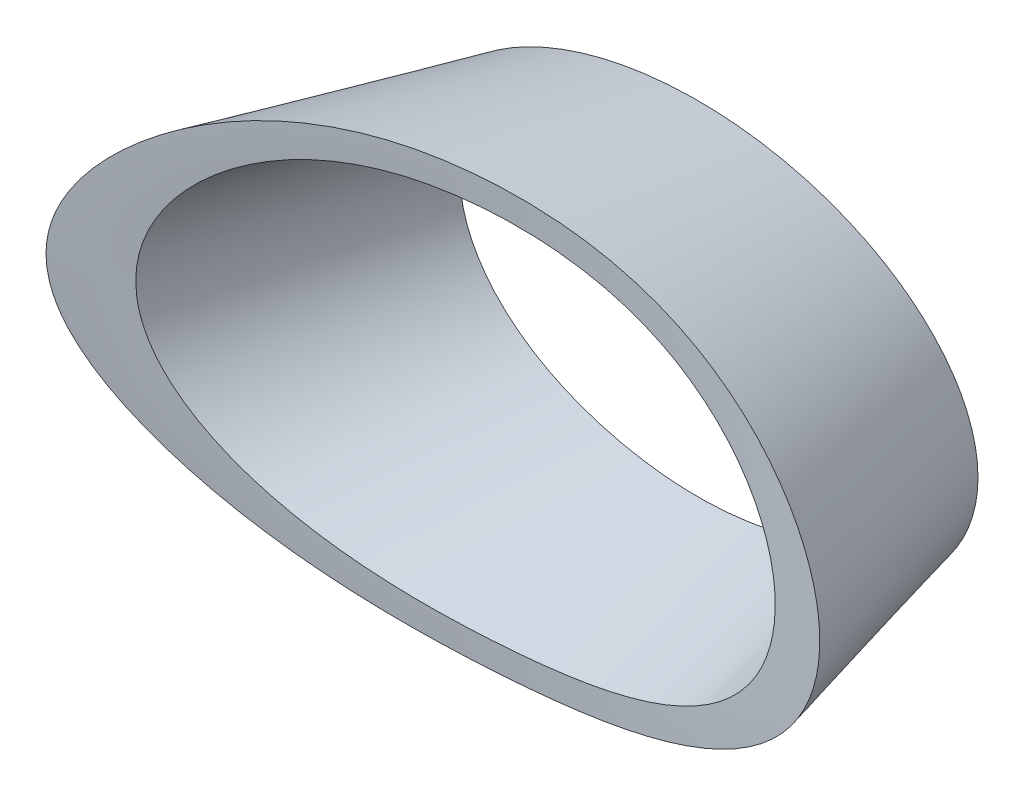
ISO-10303-21;
HEADER;
FILE_DESCRIPTION(('STEP AP214'),'2;1');
FILE_NAME('part.step','',(''),(''),'','','');
FILE_SCHEMA(('AUTOMOTIVE_DESIGN { 1 0 10303 214 1 1 1 1 }'));
ENDSEC;
DATA;
#1=APPLICATION_CONTEXT('core data for automotive mechanical design processes');
#2=APPLICATION_PROTOCOL_DEFINITION('international standard','automotive_design',2000,#1);
#3=PRODUCT_CONTEXT('',#1,'mechanical');
#4=PRODUCT('Part','Part','',(#3));
#5=PRODUCT_RELATED_PRODUCT_CATEGORY('part','',(#4));
#6=PRODUCT_DEFINITION_FORMATION('','',#4);
#7=PRODUCT_DEFINITION_CONTEXT('part definition',#1,'design');
#8=PRODUCT_DEFINITION('design','',#6,#7);
#9=PRODUCT_DEFINITION_SHAPE('','',#8);
#10=(LENGTH_UNIT() NAMED_UNIT(*) SI_UNIT(.MILLI.,.METRE.));
#11=(NAMED_UNIT(*) PLANE_ANGLE_UNIT() SI_UNIT($,.RADIAN.));
#12=(NAMED_UNIT(*) SI_UNIT($,.STERADIAN.) SOLID_ANGLE_UNIT());
#13=UNCERTAINTY_MEASURE_WITH_UNIT(LENGTH_MEASURE(1.E-05),#10,'distance_accuracy_value','');
#14=(GEOMETRIC_REPRESENTATION_CONTEXT(3) GLOBAL_UNCERTAINTY_ASSIGNED_CONTEXT((#13)) GLOBAL_UNIT_ASSIGNED_CONTEXT((#10,
#11,#12)) REPRESENTATION_CONTEXT('',''));
#15=CARTESIAN_POINT('',(0.,0.,0.));
#16=DIRECTION('',(0.,0.,1.));
#17=DIRECTION('',(1.,0.,0.));
#18=AXIS2_PLACEMENT_3D('',#15,#16,#17);
#19=CARTESIAN_POINT('',(-65.4830848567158,4.82925525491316E-06,52.7563388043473));
#20=CARTESIAN_POINT('',(-65.4831000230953,-1.72494443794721,52.7563438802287));
#21=CARTESIAN_POINT('',(-65.1156254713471,-5.16911474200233,52.6510681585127));
#22=CARTESIAN_POINT('',(-63.5266851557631,-10.1062699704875,52.2025886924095));
#23=CARTESIAN_POINT('',(-61.1027823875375,-14.6384907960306,51.5372634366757));
#24=CARTESIAN_POINT('',(-57.7186099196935,-19.1544386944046,50.6437351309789));
#25=CARTESIAN_POINT('',(-51.7328439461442,-25.0836126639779,49.1468713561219));
#26=CARTESIAN_POINT('',(-42.2539206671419,-31.1815931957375,47.0323357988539));
#27=CARTESIAN_POINT('',(-29.5288321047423,-35.9479075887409,44.7495300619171));
#28=CARTESIAN_POINT('',(-16.1322582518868,-38.4737901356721,42.9648858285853));
#29=CARTESIAN_POINT('',(-2.4341090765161,-39.1887560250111,41.7696370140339));
#30=CARTESIAN_POINT('',(11.251685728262,-38.5557845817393,41.2130712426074));
#31=CARTESIAN_POINT('',(24.8064785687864,-36.2657077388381,41.2819764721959));
#32=CARTESIAN_POINT('',(36.7115106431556,-32.1090578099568,41.8783296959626));
#33=CARTESIAN_POINT('',(46.4756342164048,-26.2943910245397,42.7250513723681));
#34=CARTESIAN_POINT('',(52.7715006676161,-20.4258532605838,43.4479515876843));
#35=CARTESIAN_POINT('',(57.7361239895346,-13.3855292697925,44.0979466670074));
#36=CARTESIAN_POINT('',(60.2995570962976,-6.78121546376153,44.4745030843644));
#37=CARTESIAN_POINT('',(60.9137009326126,0.104929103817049,44.5666152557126));
#38=CARTESIAN_POINT('',(60.2496557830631,6.98594312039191,44.4670294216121));
#39=CARTESIAN_POINT('',(57.7024648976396,13.4023376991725,44.0937148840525));
#40=CARTESIAN_POINT('',(52.7662050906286,20.4391020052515,43.4476060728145));
#41=CARTESIAN_POINT('',(46.5277408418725,26.2693666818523,42.7286568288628));
#42=CARTESIAN_POINT('',(36.6529613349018,32.1296128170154,41.8753155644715));
#43=CARTESIAN_POINT('',(24.8081079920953,36.2662062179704,41.2821712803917));
#44=CARTESIAN_POINT('',(11.2382370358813,38.5579341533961,41.2129765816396));
#45=CARTESIAN_POINT('',(-2.44764330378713,39.1888242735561,41.7705342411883));
#46=CARTESIAN_POINT('',(-16.145996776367,38.4712396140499,42.9666870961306));
#47=CARTESIAN_POINT('',(-29.5275380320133,35.9487549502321,44.7502895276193));
#48=CARTESIAN_POINT('',(-42.2540597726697,31.1814274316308,47.0320888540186));
#49=CARTESIAN_POINT('',(-51.7221201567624,25.090562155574,49.1444772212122));
#50=CARTESIAN_POINT('',(-57.710145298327,19.163695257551,50.6415421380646));
#51=CARTESIAN_POINT('',(-61.0931584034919,14.6544980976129,51.534659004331));
#52=CARTESIAN_POINT('',(-63.5239156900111,10.1123354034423,52.2018082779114));
#53=CARTESIAN_POINT('',(-65.1148326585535,5.17599910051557,52.6508409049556));
#54=CARTESIAN_POINT('',(-65.483069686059,1.7254405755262,52.7563337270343));
#55=CARTESIAN_POINT('',(-65.4830848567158,4.82925525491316E-06,52.7563388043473));
#56=CARTESIAN_POINT('',(-70.2749996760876,5.64163111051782E-06,54.2555337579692));
#57=CARTESIAN_POINT('',(-70.2750100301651,-1.82723067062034,54.255537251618));
#58=CARTESIAN_POINT('',(-69.8379614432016,-5.47368591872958,54.1196467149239));
#59=CARTESIAN_POINT('',(-68.0043417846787,-10.6425446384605,53.5608439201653));
#60=CARTESIAN_POINT('',(-65.2886348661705,-15.3393062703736,52.7610112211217));
#61=CARTESIAN_POINT('',(-61.5773791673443,-19.9973439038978,51.7148085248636));
#62=CARTESIAN_POINT('',(-55.1155726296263,-26.1089474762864,49.9970848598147));
#63=CARTESIAN_POINT('',(-45.0304228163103,-32.4411583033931,47.6187534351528));
#64=CARTESIAN_POINT('',(-31.5702609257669,-37.4714378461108,45.0772880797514));
#65=CARTESIAN_POINT('',(-17.3980585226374,-40.1969234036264,43.0983892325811));
#66=CARTESIAN_POINT('',(-2.90191620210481,-41.0131655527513,41.7872892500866));
#67=CARTESIAN_POINT('',(11.6077313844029,-40.3793789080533,41.1937751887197));
#68=CARTESIAN_POINT('',(25.9799707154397,-37.9906034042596,41.3079129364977));
#69=CARTESIAN_POINT('',(38.6086478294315,-33.6470495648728,42.0151050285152));
#70=CARTESIAN_POINT('',(48.9973355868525,-27.59528884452,43.0046985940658));
#71=CARTESIAN_POINT('',(55.7581081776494,-21.486597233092,43.8548875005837));
#72=CARTESIAN_POINT('',(61.1484467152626,-14.1371928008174,44.6296719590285));
#73=CARTESIAN_POINT('',(63.9957675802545,-7.18794137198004,45.0910355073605));
#74=CARTESIAN_POINT('',(64.6865338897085,0.111211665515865,45.2058010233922));
#75=CARTESIAN_POINT('',(63.9398541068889,7.40440457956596,45.0817786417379));
#76=CARTESIAN_POINT('',(61.1124951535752,14.1539910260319,44.6247458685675));
#77=CARTESIAN_POINT('',(55.7523529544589,21.5007124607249,43.8544544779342));
#78=CARTESIAN_POINT('',(49.0526686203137,27.5691757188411,43.0088960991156));
#79=CARTESIAN_POINT('',(38.5474611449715,33.6683112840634,42.0117078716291));
#80=CARTESIAN_POINT('',(25.9804967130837,37.9914218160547,41.3079929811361));
#81=CARTESIAN_POINT('',(11.5961395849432,40.3809259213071,41.1935191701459));
#82=CARTESIAN_POINT('',(-2.91365255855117,41.0133078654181,41.788060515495));
#83=CARTESIAN_POINT('',(-17.4103785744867,40.1945253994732,43.1001410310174));
#84=CARTESIAN_POINT('',(-31.5704283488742,37.4712766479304,45.0781973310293));
#85=CARTESIAN_POINT('',(-45.0302488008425,32.4413460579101,47.6184846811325));
#86=CARTESIAN_POINT('',(-55.1042463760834,26.116099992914,49.9944158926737));
#87=CARTESIAN_POINT('',(-61.5682296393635,20.0068224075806,51.7122859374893));
#88=CARTESIAN_POINT('',(-65.2779906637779,15.3558096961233,52.7579280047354));
#89=CARTESIAN_POINT('',(-68.0012206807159,10.6487962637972,53.5598992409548));
#90=CARTESIAN_POINT('',(-69.8370290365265,5.48090195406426,54.1193569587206));
#91=CARTESIAN_POINT('',(-70.27498931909,1.82775728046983,54.2555302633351));
#92=CARTESIAN_POINT('',(-70.2749996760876,5.64163111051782E-06,54.2555337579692));
#93=CARTESIAN_POINT('',(-75.0669144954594,6.4540069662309E-06,55.7547287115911));
#94=CARTESIAN_POINT('',(-75.0669200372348,-1.92951690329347,55.7547306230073));
#95=CARTESIAN_POINT('',(-74.560297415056,-5.77825709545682,55.588225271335));
#96=CARTESIAN_POINT('',(-72.4819984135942,-11.1788193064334,54.919099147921));
#97=CARTESIAN_POINT('',(-69.4744873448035,-16.0401217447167,53.9847590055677));
#98=CARTESIAN_POINT('',(-65.4361484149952,-20.8402491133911,52.7858819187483));
#99=CARTESIAN_POINT('',(-58.4983013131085,-27.1342822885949,50.8472983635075));
#100=CARTESIAN_POINT('',(-47.8069249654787,-33.7007234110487,48.2051710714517));
#101=CARTESIAN_POINT('',(-33.6116897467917,-38.9949681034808,45.4050460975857));
#102=CARTESIAN_POINT('',(-18.6638587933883,-41.9200566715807,43.2318926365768));
#103=CARTESIAN_POINT('',(-3.36972332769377,-42.8375750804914,41.8049414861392));
#104=CARTESIAN_POINT('',(11.9637770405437,-42.2029732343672,41.1744791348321));
#105=CARTESIAN_POINT('',(27.1534628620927,-39.7154990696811,41.3338494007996));
#106=CARTESIAN_POINT('',(40.5057850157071,-35.1850413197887,42.1518803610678));
#107=CARTESIAN_POINT('',(51.5190369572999,-28.8961866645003,43.2843458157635));
#108=CARTESIAN_POINT('',(58.7447156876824,-22.5473412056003,44.2618234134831));
#109=CARTESIAN_POINT('',(64.5607694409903,-14.8888563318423,45.1613972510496));
#110=CARTESIAN_POINT('',(67.691978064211,-7.59466728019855,45.7075679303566));
#111=CARTESIAN_POINT('',(68.459366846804,0.117494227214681,45.8449867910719));
#112=CARTESIAN_POINT('',(67.6300524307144,7.82286603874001,45.6965278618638));
#113=CARTESIAN_POINT('',(64.5225254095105,14.9056443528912,45.1557768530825));
#114=CARTESIAN_POINT('',(58.7385008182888,22.5623229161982,44.2613028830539));
#115=CARTESIAN_POINT('',(51.5775963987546,28.8689847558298,43.2891353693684));
#116=CARTESIAN_POINT('',(40.4419609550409,35.2070097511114,42.1481001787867));
#117=CARTESIAN_POINT('',(27.1528854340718,39.716637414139,41.3338146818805));
#118=CARTESIAN_POINT('',(11.9540421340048,42.2039176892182,41.1740617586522));
#119=CARTESIAN_POINT('',(-3.37966181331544,42.83779145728,41.8055867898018));
#120=CARTESIAN_POINT('',(-18.6747603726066,41.9178111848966,43.2335949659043));
#121=CARTESIAN_POINT('',(-33.6133186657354,38.9937983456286,45.4061051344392));
#122=CARTESIAN_POINT('',(-47.8064378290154,33.7012646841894,48.2048805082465));
#123=CARTESIAN_POINT('',(-58.4863725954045,27.141637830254,50.8443545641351));
#124=CARTESIAN_POINT('',(-65.4263139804,20.8499495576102,52.7830297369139));
#125=CARTESIAN_POINT('',(-69.4628229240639,16.0571212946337,53.9811970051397));
#126=CARTESIAN_POINT('',(-72.4785256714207,11.1852571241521,54.9179902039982));
#127=CARTESIAN_POINT('',(-74.5592254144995,5.78580480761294,55.5878730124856));
#128=CARTESIAN_POINT('',(-75.066908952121,1.93007398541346,55.7547267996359));
#129=CARTESIAN_POINT('',(-75.0669144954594,6.4540069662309E-06,55.7547287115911));
#130=CARTESIAN_POINT('',(-79.8588293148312,7.26638282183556E-06,57.253923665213));
#131=CARTESIAN_POINT('',(-79.8588300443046,-2.0318031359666,57.2539239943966));
#132=CARTESIAN_POINT('',(-79.2826333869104,-6.08282827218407,57.0568038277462));
#133=CARTESIAN_POINT('',(-76.9596550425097,-11.7150939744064,56.2773543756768));
#134=CARTESIAN_POINT('',(-73.6603398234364,-16.7409372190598,55.2085067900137));
#135=CARTESIAN_POINT('',(-69.294917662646,-21.6831543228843,53.856955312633));
#136=CARTESIAN_POINT('',(-61.8810299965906,-28.1596171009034,51.6975118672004));
#137=CARTESIAN_POINT('',(-50.5834271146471,-34.9602885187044,48.7915887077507));
#138=CARTESIAN_POINT('',(-35.6531185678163,-40.5184983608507,45.73280411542));
#139=CARTESIAN_POINT('',(-19.929659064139,-43.643189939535,43.3653960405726));
#140=CARTESIAN_POINT('',(-3.83753045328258,-44.6619846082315,41.8225937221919));
#141=CARTESIAN_POINT('',(12.3198226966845,-44.0265675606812,41.1551830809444));
#142=CARTESIAN_POINT('',(28.3269550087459,-41.4403947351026,41.3597858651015));
#143=CARTESIAN_POINT('',(42.4029222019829,-36.7230330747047,42.2886556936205));
#144=CARTESIAN_POINT('',(54.0407383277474,-30.1970844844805,43.5639930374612));
#145=CARTESIAN_POINT('',(61.7313231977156,-23.6080851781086,44.6687593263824));
#146=CARTESIAN_POINT('',(67.9730921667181,-15.6405198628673,45.6931225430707));
#147=CARTESIAN_POINT('',(71.3881885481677,-8.00139318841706,46.3241003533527));
#148=CARTESIAN_POINT('',(72.2321998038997,0.123776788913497,46.4841725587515));
#149=CARTESIAN_POINT('',(71.3202507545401,8.24132749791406,46.3112770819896));
#150=CARTESIAN_POINT('',(67.932555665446,15.6572976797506,45.6868078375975));
#151=CARTESIAN_POINT('',(61.7246486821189,23.6239333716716,44.6681512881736));
#152=CARTESIAN_POINT('',(54.1025241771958,30.1687937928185,43.5693746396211));
#153=CARTESIAN_POINT('',(42.3364607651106,36.7457082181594,42.2844924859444));
#154=CARTESIAN_POINT('',(28.3252741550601,41.4418530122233,41.3596363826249));
#155=CARTESIAN_POINT('',(12.3119446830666,44.0269094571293,41.1546043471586));
#156=CARTESIAN_POINT('',(-3.8456710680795,44.662275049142,41.8231130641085));
#157=CARTESIAN_POINT('',(-19.9391421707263,43.6410969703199,43.3670489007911));
#158=CARTESIAN_POINT('',(-35.6562089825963,40.5163200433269,45.7340129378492));
#159=CARTESIAN_POINT('',(-50.5826268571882,34.9611833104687,48.7912763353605));
#160=CARTESIAN_POINT('',(-61.8684988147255,28.167175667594,51.6942932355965));
#161=CARTESIAN_POINT('',(-69.2843983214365,21.6930767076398,53.8537735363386));
#162=CARTESIAN_POINT('',(-73.6476551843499,16.7584328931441,55.204466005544));
#163=CARTESIAN_POINT('',(-76.9558306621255,11.721717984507,56.2760811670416));
#164=CARTESIAN_POINT('',(-79.2814217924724,6.09070766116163,57.0563890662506));
#165=CARTESIAN_POINT('',(-79.858828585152,2.03239069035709,57.2539233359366));
#166=CARTESIAN_POINT('',(-79.8588293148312,7.26638282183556E-06,57.253923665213));
#167=B_SPLINE_SURFACE_WITH_KNOTS('',3,3,((#19,#20,#21,#22,#23,#24,#25,#26,#27,#28,#29,#30,#31,
#32,#33,#34,#35,#36,#37,#38,#39,#40,#41,#42,#43,#44,#45,#46,#47,#48,#49,#50,#51,#52,#53,#54,
#55),(#56,#57,#58,#59,#60,#61,#62,#63,#64,#65,#66,#67,#68,#69,#70,#71,#72,#73,#74,#75,#76,#77,
#78,#79,#80,#81,#82,#83,#84,#85,#86,#87,#88,#89,#90,#91,#92),(#93,#94,#95,#96,#97,#98,#99,#100,
#101,#102,#103,#104,#105,#106,#107,#108,#109,#110,#111,#112,#113,#114,#115,#116,#117,#118,#119,
#120,#121,#122,#123,#124,#125,#126,#127,#128,#129),(#130,#131,#132,#133,#134,#135,#136,#137,
#138,#139,#140,#141,#142,#143,#144,#145,#146,#147,#148,#149,#150,#151,#152,#153,#154,#155,#156,
#157,#158,#159,#160,#161,#162,#163,#164,#165,#166)),.UNSPECIFIED.,.F.,.T.,.F.,(4,4),(4,1,1,1,1,
1,1,1,1,1,1,1,1,1,1,1,1,1,1,1,1,1,1,1,1,1,1,1,1,1,1,1,1,1,4),(0.,1.),(0.,0.0157082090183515,
0.0313652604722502,0.0471860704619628,0.0627738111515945,0.0833333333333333,0.125,
0.166666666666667,0.208333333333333,0.25,0.291666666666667,0.333333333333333,0.375,
0.406194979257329,0.436595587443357,0.453287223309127,0.484684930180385,0.500267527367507,
0.516003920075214,0.547390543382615,0.562321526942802,0.594368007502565,0.625,0.666666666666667,
0.708333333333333,0.75012724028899,0.791666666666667,0.833333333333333,0.875,0.916666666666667,
0.937110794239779,0.952815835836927,0.968578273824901,0.984287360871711,1.),.UNSPECIFIED.);
#168=CARTESIAN_POINT('',(-65.4830848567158,4.82925525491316E-06,52.7563388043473));
#169=CARTESIAN_POINT('',(-65.4831000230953,-1.72494443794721,52.7563438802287));
#170=CARTESIAN_POINT('',(-65.1156254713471,-5.16911474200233,52.6510681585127));
#171=CARTESIAN_POINT('',(-63.5266851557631,-10.1062699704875,52.2025886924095));
#172=CARTESIAN_POINT('',(-61.1027823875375,-14.6384907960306,51.5372634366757));
#173=CARTESIAN_POINT('',(-57.7186099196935,-19.1544386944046,50.6437351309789));
#174=CARTESIAN_POINT('',(-51.7328439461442,-25.0836126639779,49.1468713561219));
#175=CARTESIAN_POINT('',(-42.2539206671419,-31.1815931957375,47.0323357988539));
#176=CARTESIAN_POINT('',(-29.5288321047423,-35.9479075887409,44.7495300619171));
#177=CARTESIAN_POINT('',(-16.1322582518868,-38.4737901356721,42.9648858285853));
#178=CARTESIAN_POINT('',(-2.4341090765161,-39.1887560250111,41.7696370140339));
#179=CARTESIAN_POINT('',(11.251685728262,-38.5557845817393,41.2130712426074));
#180=CARTESIAN_POINT('',(24.8064785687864,-36.2657077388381,41.2819764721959));
#181=CARTESIAN_POINT('',(36.7115106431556,-32.1090578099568,41.8783296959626));
#182=CARTESIAN_POINT('',(46.4756342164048,-26.2943910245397,42.7250513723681));
#183=CARTESIAN_POINT('',(52.7715006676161,-20.4258532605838,43.4479515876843));
#184=CARTESIAN_POINT('',(57.7361239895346,-13.3855292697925,44.0979466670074));
#185=CARTESIAN_POINT('',(60.2995570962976,-6.78121546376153,44.4745030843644));
#186=CARTESIAN_POINT('',(60.9137009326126,0.104929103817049,44.5666152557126));
#187=CARTESIAN_POINT('',(60.2496557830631,6.98594312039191,44.4670294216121));
#188=CARTESIAN_POINT('',(57.7024648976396,13.4023376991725,44.0937148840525));
#189=CARTESIAN_POINT('',(52.7662050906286,20.4391020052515,43.4476060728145));
#190=CARTESIAN_POINT('',(46.5277408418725,26.2693666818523,42.7286568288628));
#191=CARTESIAN_POINT('',(36.6529613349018,32.1296128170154,41.8753155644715));
#192=CARTESIAN_POINT('',(24.8081079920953,36.2662062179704,41.2821712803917));
#193=CARTESIAN_POINT('',(11.2382370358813,38.5579341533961,41.2129765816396));
#194=CARTESIAN_POINT('',(-2.44764330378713,39.1888242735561,41.7705342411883));
#195=CARTESIAN_POINT('',(-16.145996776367,38.4712396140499,42.9666870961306));
#196=CARTESIAN_POINT('',(-29.5275380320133,35.9487549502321,44.7502895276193));
#197=CARTESIAN_POINT('',(-42.2540597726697,31.1814274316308,47.0320888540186));
#198=CARTESIAN_POINT('',(-51.7221201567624,25.090562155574,49.1444772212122));
#199=CARTESIAN_POINT('',(-57.710145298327,19.163695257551,50.6415421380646));
#200=CARTESIAN_POINT('',(-61.0931584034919,14.6544980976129,51.534659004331));
#201=CARTESIAN_POINT('',(-63.5239156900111,10.1123354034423,52.2018082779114));
#202=CARTESIAN_POINT('',(-65.1148326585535,5.17599910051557,52.6508409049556));
#203=CARTESIAN_POINT('',(-65.483069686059,1.7254405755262,52.7563337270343));
#204=CARTESIAN_POINT('',(-65.4830848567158,4.82925525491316E-06,52.7563388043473));
#205=B_SPLINE_CURVE_WITH_KNOTS('',3,(#168,#169,#170,#171,#172,#173,#174,#175,#176,#177,#178,
#179,#180,#181,#182,#183,#184,#185,#186,#187,#188,#189,#190,#191,#192,#193,#194,#195,#196,#197,
#198,#199,#200,#201,#202,#203,#204),.UNSPECIFIED.,.T.,.F.,(4,1,1,1,1,1,1,1,1,1,1,1,1,1,1,1,1,1,
1,1,1,1,1,1,1,1,1,1,1,1,1,1,1,1,4),(0.,0.0157082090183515,0.0313652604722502,0.0471860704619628,
0.0627738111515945,0.0833333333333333,0.125,0.166666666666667,0.208333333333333,0.25,
0.291666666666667,0.333333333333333,0.375,0.406194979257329,0.436595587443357,0.453287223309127,
0.484684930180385,0.500267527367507,0.516003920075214,0.547390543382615,0.562321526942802,
0.594368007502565,0.625,0.666666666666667,0.708333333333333,0.75012724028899,0.791666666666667,
0.833333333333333,0.875,0.916666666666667,0.937110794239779,0.952815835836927,0.968578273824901,
0.984287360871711,1.),.UNSPECIFIED.);
#206=CARTESIAN_POINT('',(-65.4830848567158,4.82925525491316E-06,52.7563388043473));
#207=VERTEX_POINT('',#206);
#208=EDGE_CURVE('E47',#207,#207,#205,.F.);
#209=CARTESIAN_POINT('',(-79.8588293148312,7.26638282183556E-06,57.253923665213));
#210=CARTESIAN_POINT('',(-79.8588300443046,-2.0318031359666,57.2539239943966));
#211=CARTESIAN_POINT('',(-79.2826333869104,-6.08282827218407,57.0568038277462));
#212=CARTESIAN_POINT('',(-76.9596550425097,-11.7150939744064,56.2773543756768));
#213=CARTESIAN_POINT('',(-73.6603398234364,-16.7409372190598,55.2085067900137));
#214=CARTESIAN_POINT('',(-69.294917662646,-21.6831543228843,53.856955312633));
#215=CARTESIAN_POINT('',(-61.8810299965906,-28.1596171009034,51.6975118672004));
#216=CARTESIAN_POINT('',(-50.5834271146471,-34.9602885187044,48.7915887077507));
#217=CARTESIAN_POINT('',(-35.6531185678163,-40.5184983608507,45.73280411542));
#218=CARTESIAN_POINT('',(-19.929659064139,-43.643189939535,43.3653960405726));
#219=CARTESIAN_POINT('',(-3.83753045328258,-44.6619846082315,41.8225937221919));
#220=CARTESIAN_POINT('',(12.3198226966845,-44.0265675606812,41.1551830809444));
#221=CARTESIAN_POINT('',(28.3269550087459,-41.4403947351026,41.3597858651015));
#222=CARTESIAN_POINT('',(42.4029222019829,-36.7230330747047,42.2886556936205));
#223=CARTESIAN_POINT('',(54.0407383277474,-30.1970844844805,43.5639930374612));
#224=CARTESIAN_POINT('',(61.7313231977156,-23.6080851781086,44.6687593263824));
#225=CARTESIAN_POINT('',(67.9730921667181,-15.6405198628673,45.6931225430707));
#226=CARTESIAN_POINT('',(71.3881885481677,-8.00139318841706,46.3241003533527));
#227=CARTESIAN_POINT('',(72.2321998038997,0.123776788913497,46.4841725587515));
#228=CARTESIAN_POINT('',(71.3202507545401,8.24132749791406,46.3112770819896));
#229=CARTESIAN_POINT('',(67.932555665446,15.6572976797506,45.6868078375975));
#230=CARTESIAN_POINT('',(61.7246486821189,23.6239333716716,44.6681512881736));
#231=CARTESIAN_POINT('',(54.1025241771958,30.1687937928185,43.5693746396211));
#232=CARTESIAN_POINT('',(42.3364607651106,36.7457082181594,42.2844924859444));
#233=CARTESIAN_POINT('',(28.3252741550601,41.4418530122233,41.3596363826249));
#234=CARTESIAN_POINT('',(12.3119446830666,44.0269094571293,41.1546043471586));
#235=CARTESIAN_POINT('',(-3.8456710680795,44.662275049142,41.8231130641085));
#236=CARTESIAN_POINT('',(-19.9391421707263,43.6410969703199,43.3670489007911));
#237=CARTESIAN_POINT('',(-35.6562089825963,40.5163200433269,45.7340129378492));
#238=CARTESIAN_POINT('',(-50.5826268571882,34.9611833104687,48.7912763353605));
#239=CARTESIAN_POINT('',(-61.8684988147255,28.167175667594,51.6942932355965));
#240=CARTESIAN_POINT('',(-69.2843983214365,21.6930767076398,53.8537735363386));
#241=CARTESIAN_POINT('',(-73.6476551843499,16.7584328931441,55.204466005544));
#242=CARTESIAN_POINT('',(-76.9558306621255,11.721717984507,56.2760811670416));
#243=CARTESIAN_POINT('',(-79.2814217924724,6.09070766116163,57.0563890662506));
#244=CARTESIAN_POINT('',(-79.858828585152,2.03239069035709,57.2539233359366));
#245=CARTESIAN_POINT('',(-79.8588293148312,7.26638282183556E-06,57.253923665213));
#246=B_SPLINE_CURVE_WITH_KNOTS('',3,(#209,#210,#211,#212,#213,#214,#215,#216,#217,#218,#219,
#220,#221,#222,#223,#224,#225,#226,#227,#228,#229,#230,#231,#232,#233,#234,#235,#236,#237,#238,
#239,#240,#241,#242,#243,#244,#245),.UNSPECIFIED.,.T.,.F.,(4,1,1,1,1,1,1,1,1,1,1,1,1,1,1,1,1,1,
1,1,1,1,1,1,1,1,1,1,1,1,1,1,1,1,4),(0.,0.0157082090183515,0.0313652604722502,0.0471860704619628,
0.0627738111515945,0.0833333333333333,0.125,0.166666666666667,0.208333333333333,0.25,
0.291666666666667,0.333333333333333,0.375,0.406194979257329,0.436595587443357,0.453287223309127,
0.484684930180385,0.500267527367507,0.516003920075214,0.547390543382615,0.562321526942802,
0.594368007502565,0.625,0.666666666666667,0.708333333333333,0.75012724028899,0.791666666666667,
0.833333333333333,0.875,0.916666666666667,0.937110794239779,0.952815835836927,0.968578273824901,
0.984287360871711,1.),.UNSPECIFIED.);
#247=CARTESIAN_POINT('',(-79.8588293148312,7.26638282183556E-06,57.253923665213));
#248=VERTEX_POINT('',#247);
#249=EDGE_CURVE('E43',#248,#248,#246,.T.);
#250=ORIENTED_EDGE('',*,*,#208,.T.);
#251=EDGE_LOOP('',(#250));
#252=FACE_BOUND('',#251,.T.);
#253=ORIENTED_EDGE('',*,*,#249,.T.);
#254=EDGE_LOOP('',(#253));
#255=FACE_BOUND('',#254,.T.);
#256=ADVANCED_FACE('F30',(#252,#255),#167,.T.);
#257=CARTESIAN_POINT('',(-50.,0.,0.));
#258=CARTESIAN_POINT('',(-50.,-1.10298482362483,0.));
#259=CARTESIAN_POINT('',(-49.8218116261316,-3.30536233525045,0.));
#260=CARTESIAN_POINT('',(-49.0467663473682,-6.58231629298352,0.));
#261=CARTESIAN_POINT('',(-47.7944222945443,-9.7783179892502,0.));
#262=CARTESIAN_POINT('',(-45.9150133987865,-13.1869154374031,0.));
#263=CARTESIAN_POINT('',(-42.2984436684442,-18.0149405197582,0.));
#264=CARTESIAN_POINT('',(-35.787145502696,-23.6195160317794,0.));
#265=CARTESIAN_POINT('',(-25.5701519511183,-28.7900553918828,0.));
#266=CARTESIAN_POINT('',(-13.2986924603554,-32.1711895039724,0.));
#267=CARTESIAN_POINT('',(0.,-33.4144052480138,0.));
#268=CARTESIAN_POINT('',(13.2986924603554,-32.1711895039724,0.));
#269=CARTESIAN_POINT('',(25.5701519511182,-28.7900553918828,0.));
#270=CARTESIAN_POINT('',(34.9312322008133,-24.0526702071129,0.));
#271=CARTESIAN_POINT('',(41.6503659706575,-18.6453688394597,0.));
#272=CARTESIAN_POINT('',(45.5310340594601,-13.8848385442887,0.));
#273=CARTESIAN_POINT('',(48.374087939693,-8.73663416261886,0.));
#274=CARTESIAN_POINT('',(49.7471783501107,-4.33692923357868,0.));
#275=CARTESIAN_POINT('',(50.0885019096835,0.0672564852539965,0.));
#276=CARTESIAN_POINT('',(49.7198141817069,4.46984319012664,0.));
#277=CARTESIAN_POINT('',(48.3543369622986,8.7535786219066,0.));
#278=CARTESIAN_POINT('',(45.5265280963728,13.8945490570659,0.));
#279=CARTESIAN_POINT('',(41.6882496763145,18.6208205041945,0.));
#280=CARTESIAN_POINT('',(34.8852159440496,24.0759577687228,0.));
#281=CARTESIAN_POINT('',(25.5701519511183,28.7900567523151,0.));
#282=CARTESIAN_POINT('',(13.28620106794,32.1746246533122,0.));
#283=CARTESIAN_POINT('',(-0.0140598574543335,33.4142501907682,0.));
#284=CARTESIAN_POINT('',(-13.3111838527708,32.1677432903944,0.));
#285=CARTESIAN_POINT('',(-25.5701519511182,28.7900553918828,0.));
#286=CARTESIAN_POINT('',(-35.787145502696,23.6195160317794,0.));
#287=CARTESIAN_POINT('',(-42.2912115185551,18.0211655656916,0.));
#288=CARTESIAN_POINT('',(-45.9102070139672,13.1941910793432,0.));
#289=CARTESIAN_POINT('',(-47.7893682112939,9.78972903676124,0.));
#290=CARTESIAN_POINT('',(-49.0454462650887,6.58638419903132,0.));
#291=CARTESIAN_POINT('',(-49.821440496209,3.30963826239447,0.));
#292=CARTESIAN_POINT('',(-50.,1.10329589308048,0.));
#293=CARTESIAN_POINT('',(-50.,0.,0.));
#294=CARTESIAN_POINT('',(-55.1610282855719,1.60975175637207E-06,17.5854462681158));
#295=CARTESIAN_POINT('',(-55.1610333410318,-1.31030469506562,17.5854479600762));
#296=CARTESIAN_POINT('',(-54.9197495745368,-3.92661313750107,17.5503560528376));
#297=CARTESIAN_POINT('',(-53.8734059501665,-7.75696751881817,17.4008628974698));
#298=CARTESIAN_POINT('',(-52.230542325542,-11.3983755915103,17.1790878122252));
#299=CARTESIAN_POINT('',(-49.8495455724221,-15.1760898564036,16.8812450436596));
#300=CARTESIAN_POINT('',(-45.4432437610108,-20.3711645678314,16.3822904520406));
#301=CARTESIAN_POINT('',(-37.942737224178,-26.1402084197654,15.6774452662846));
#302=CARTESIAN_POINT('',(-26.8897120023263,-31.1760061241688,14.916510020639));
#303=CARTESIAN_POINT('',(-14.2432143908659,-34.2720563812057,14.3216286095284));
#304=CARTESIAN_POINT('',(-0.811369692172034,-35.3391888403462,13.9232123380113));
#305=CARTESIAN_POINT('',(12.6163568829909,-34.2993878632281,13.7376904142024));
#306=CARTESIAN_POINT('',(25.3155941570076,-31.2819395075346,13.7606588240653));
#307=CARTESIAN_POINT('',(35.5246583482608,-26.7381327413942,13.9594432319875));
#308=CARTESIAN_POINT('',(43.2587887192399,-21.195042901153,14.2416837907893));
#309=CARTESIAN_POINT('',(47.9445229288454,-16.0651767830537,14.4826505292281));
#310=CARTESIAN_POINT('',(51.4947666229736,-10.2862658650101,14.6993155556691));
#311=CARTESIAN_POINT('',(53.264637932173,-5.15169131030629,14.8248343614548));
#312=CARTESIAN_POINT('',(53.6969015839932,0.0798140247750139,14.8555384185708));
#313=CARTESIAN_POINT('',(53.2297613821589,5.30854316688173,14.8223431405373));
#314=CARTESIAN_POINT('',(51.4703796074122,10.3031649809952,14.6979049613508));
#315=CARTESIAN_POINT('',(47.9397537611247,16.0760667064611,14.4825353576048));
#316=CARTESIAN_POINT('',(43.3014133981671,21.1703358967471,14.2428856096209));
#317=CARTESIAN_POINT('',(35.474464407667,26.760509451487,13.9584385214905));
#318=CARTESIAN_POINT('',(25.3161372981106,31.2821065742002,13.7607237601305));
#319=CARTESIAN_POINT('',(12.6035463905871,34.3023944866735,13.7376588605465));
#320=CARTESIAN_POINT('',(-0.825254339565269,35.3391082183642,13.9235114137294));
#321=CARTESIAN_POINT('',(-14.2561214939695,34.2689087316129,14.3222290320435));
#322=CARTESIAN_POINT('',(-26.8892806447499,31.1762885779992,14.9167631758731));
#323=CARTESIAN_POINT('',(-37.9427835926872,26.1401531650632,15.6773629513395));
#324=CARTESIAN_POINT('',(-45.4348477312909,20.3776310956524,16.3814924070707));
#325=CARTESIAN_POINT('',(-49.8435197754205,15.1840258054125,16.8805140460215));
#326=CARTESIAN_POINT('',(-52.2239649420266,11.4113187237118,17.1782196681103));
#327=CARTESIAN_POINT('',(-53.8716027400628,7.76170126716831,17.4006027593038));
#328=CARTESIAN_POINT('',(-54.9192378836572,3.93175854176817,17.5502803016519));
#329=CARTESIAN_POINT('',(-55.1610232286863,1.31067745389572,17.5854445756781));
#330=CARTESIAN_POINT('',(-55.1610282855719,1.60975175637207E-06,17.5854462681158));
#331=CARTESIAN_POINT('',(-60.3220565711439,3.21950350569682E-06,35.1708925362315));
#332=CARTESIAN_POINT('',(-60.3220666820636,-1.51762456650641,35.1708959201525));
#333=CARTESIAN_POINT('',(-60.017687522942,-4.5478639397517,35.1007121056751));
#334=CARTESIAN_POINT('',(-58.7000455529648,-8.93161874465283,34.8017257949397));
#335=CARTESIAN_POINT('',(-56.6666623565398,-13.0184331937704,34.3581756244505));
#336=CARTESIAN_POINT('',(-53.7840777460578,-17.1652642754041,33.7624900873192));
#337=CARTESIAN_POINT('',(-48.5880438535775,-22.7273886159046,32.7645809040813));
#338=CARTESIAN_POINT('',(-40.09832894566,-28.6609008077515,31.3548905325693));
#339=CARTESIAN_POINT('',(-28.2092720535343,-33.5619568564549,29.833020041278));
#340=CARTESIAN_POINT('',(-15.1877363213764,-36.3729232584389,28.6432572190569));
#341=CARTESIAN_POINT('',(-1.62273938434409,-37.2639724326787,27.8464246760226));
#342=CARTESIAN_POINT('',(11.9340213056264,-36.4275862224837,27.4753808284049));
#343=CARTESIAN_POINT('',(25.061036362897,-33.7738236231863,27.5213176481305));
#344=CARTESIAN_POINT('',(36.1180844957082,-29.4235952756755,27.918886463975));
#345=CARTESIAN_POINT('',(44.8672114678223,-23.7447169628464,28.4833675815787));
#346=CARTESIAN_POINT('',(50.3580117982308,-18.2455150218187,28.9653010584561));
#347=CARTESIAN_POINT('',(54.6154453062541,-11.8358975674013,29.3986311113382));
#348=CARTESIAN_POINT('',(56.7820975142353,-5.96645338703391,29.6496687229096));
#349=CARTESIAN_POINT('',(57.3053012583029,0.0923715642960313,29.7110768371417));
#350=CARTESIAN_POINT('',(56.739708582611,6.14724314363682,29.6446862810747));
#351=CARTESIAN_POINT('',(54.5864222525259,11.8527513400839,29.3958099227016));
#352=CARTESIAN_POINT('',(50.3529794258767,18.2575843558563,28.9650707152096));
#353=CARTESIAN_POINT('',(44.9145771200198,23.7198512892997,28.4857712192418));
#354=CARTESIAN_POINT('',(36.0637128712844,29.4450611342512,27.916877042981));
#355=CARTESIAN_POINT('',(25.062122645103,33.7741563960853,27.5214475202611));
#356=CARTESIAN_POINT('',(11.9208917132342,36.4301643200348,27.475317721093));
#357=CARTESIAN_POINT('',(-1.63644882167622,37.2639662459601,27.8470228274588));
#358=CARTESIAN_POINT('',(-15.2010591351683,36.3700741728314,28.6444580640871));
#359=CARTESIAN_POINT('',(-28.2084093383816,33.5625217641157,29.8335263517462));
#360=CARTESIAN_POINT('',(-40.0984216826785,28.660790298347,31.354725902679));
#361=CARTESIAN_POINT('',(-48.5784839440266,22.7340966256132,32.7629848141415));
#362=CARTESIAN_POINT('',(-53.7768325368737,17.1738605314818,33.7610280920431));
#363=CARTESIAN_POINT('',(-56.6585616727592,13.0329084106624,34.3564393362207));
#364=CARTESIAN_POINT('',(-58.697759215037,8.9370183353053,34.8012055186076));
#365=CARTESIAN_POINT('',(-60.0170352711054,4.55387882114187,35.1005606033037));
#366=CARTESIAN_POINT('',(-60.3220464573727,1.51805901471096,35.1708891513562));
#367=CARTESIAN_POINT('',(-60.3220565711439,3.21950350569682E-06,35.1708925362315));
#368=CARTESIAN_POINT('',(-65.4830848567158,4.82925525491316E-06,52.7563388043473));
#369=CARTESIAN_POINT('',(-65.4831000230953,-1.72494443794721,52.7563438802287));
#370=CARTESIAN_POINT('',(-65.1156254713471,-5.16911474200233,52.6510681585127));
#371=CARTESIAN_POINT('',(-63.5266851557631,-10.1062699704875,52.2025886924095));
#372=CARTESIAN_POINT('',(-61.1027823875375,-14.6384907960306,51.5372634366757));
#373=CARTESIAN_POINT('',(-57.7186099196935,-19.1544386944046,50.6437351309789));
#374=CARTESIAN_POINT('',(-51.7328439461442,-25.0836126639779,49.1468713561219));
#375=CARTESIAN_POINT('',(-42.2539206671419,-31.1815931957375,47.0323357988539));
#376=CARTESIAN_POINT('',(-29.5288321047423,-35.9479075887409,44.7495300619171));
#377=CARTESIAN_POINT('',(-16.1322582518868,-38.4737901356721,42.9648858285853));
#378=CARTESIAN_POINT('',(-2.4341090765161,-39.1887560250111,41.7696370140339));
#379=CARTESIAN_POINT('',(11.251685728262,-38.5557845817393,41.2130712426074));
#380=CARTESIAN_POINT('',(24.8064785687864,-36.2657077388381,41.2819764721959));
#381=CARTESIAN_POINT('',(36.7115106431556,-32.1090578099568,41.8783296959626));
#382=CARTESIAN_POINT('',(46.4756342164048,-26.2943910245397,42.7250513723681));
#383=CARTESIAN_POINT('',(52.7715006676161,-20.4258532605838,43.4479515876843));
#384=CARTESIAN_POINT('',(57.7361239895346,-13.3855292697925,44.0979466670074));
#385=CARTESIAN_POINT('',(60.2995570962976,-6.78121546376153,44.4745030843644));
#386=CARTESIAN_POINT('',(60.9137009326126,0.104929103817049,44.5666152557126));
#387=CARTESIAN_POINT('',(60.2496557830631,6.98594312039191,44.4670294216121));
#388=CARTESIAN_POINT('',(57.7024648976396,13.4023376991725,44.0937148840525));
#389=CARTESIAN_POINT('',(52.7662050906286,20.4391020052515,43.4476060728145));
#390=CARTESIAN_POINT('',(46.5277408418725,26.2693666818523,42.7286568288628));
#391=CARTESIAN_POINT('',(36.6529613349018,32.1296128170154,41.8753155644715));
#392=CARTESIAN_POINT('',(24.8081079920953,36.2662062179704,41.2821712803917));
#393=CARTESIAN_POINT('',(11.2382370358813,38.5579341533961,41.2129765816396));
#394=CARTESIAN_POINT('',(-2.44764330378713,39.1888242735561,41.7705342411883));
#395=CARTESIAN_POINT('',(-16.145996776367,38.4712396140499,42.9666870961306));
#396=CARTESIAN_POINT('',(-29.5275380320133,35.9487549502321,44.7502895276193));
#397=CARTESIAN_POINT('',(-42.2540597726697,31.1814274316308,47.0320888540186));
#398=CARTESIAN_POINT('',(-51.7221201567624,25.090562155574,49.1444772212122));
#399=CARTESIAN_POINT('',(-57.710145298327,19.163695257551,50.6415421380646));
#400=CARTESIAN_POINT('',(-61.0931584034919,14.6544980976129,51.534659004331));
#401=CARTESIAN_POINT('',(-63.5239156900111,10.1123354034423,52.2018082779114));
#402=CARTESIAN_POINT('',(-65.1148326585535,5.17599910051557,52.6508409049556));
#403=CARTESIAN_POINT('',(-65.483069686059,1.7254405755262,52.7563337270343));
#404=CARTESIAN_POINT('',(-65.4830848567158,4.82925525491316E-06,52.7563388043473));
#405=B_SPLINE_SURFACE_WITH_KNOTS('',3,3,((#257,#258,#259,#260,#261,#262,#263,#264,#265,#266,
#267,#268,#269,#270,#271,#272,#273,#274,#275,#276,#277,#278,#279,#280,#281,#282,#283,#284,#285,
#286,#287,#288,#289,#290,#291,#292,#293),(#294,#295,#296,#297,#298,#299,#300,#301,#302,#303,
#304,#305,#306,#307,#308,#309,#310,#311,#312,#313,#314,#315,#316,#317,#318,#319,#320,#321,#322,
#323,#324,#325,#326,#327,#328,#329,#330),(#331,#332,#333,#334,#335,#336,#337,#338,#339,#340,
#341,#342,#343,#344,#345,#346,#347,#348,#349,#350,#351,#352,#353,#354,#355,#356,#357,#358,#359,
#360,#361,#362,#363,#364,#365,#366,#367),(#368,#369,#370,#371,#372,#373,#374,#375,#376,#377,
#378,#379,#380,#381,#382,#383,#384,#385,#386,#387,#388,#389,#390,#391,#392,#393,#394,#395,#396,
#397,#398,#399,#400,#401,#402,#403,#404)),.UNSPECIFIED.,.F.,.T.,.F.,(4,4),(4,1,1,1,1,1,1,1,1,1,
1,1,1,1,1,1,1,1,1,1,1,1,1,1,1,1,1,1,1,1,1,1,1,1,4),(0.,1.),(0.,0.0157082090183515,
0.0313652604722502,0.0471860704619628,0.0627738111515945,0.0833333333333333,0.125,
0.166666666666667,0.208333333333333,0.25,0.291666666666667,0.333333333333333,0.375,
0.406194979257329,0.436595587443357,0.453287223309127,0.484684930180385,0.500267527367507,
0.516003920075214,0.547390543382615,0.562321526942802,0.594368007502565,0.625,0.666666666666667,
0.708333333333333,0.75012724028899,0.791666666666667,0.833333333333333,0.875,0.916666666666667,
0.937110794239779,0.952815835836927,0.968578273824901,0.984287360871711,1.),.UNSPECIFIED.);
#406=CARTESIAN_POINT('',(-50.,0.,0.));
#407=CARTESIAN_POINT('',(-50.,-1.10298482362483,0.));
#408=CARTESIAN_POINT('',(-49.8218116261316,-3.30536233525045,0.));
#409=CARTESIAN_POINT('',(-49.0467663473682,-6.58231629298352,0.));
#410=CARTESIAN_POINT('',(-47.7944222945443,-9.7783179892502,0.));
#411=CARTESIAN_POINT('',(-45.9150133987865,-13.1869154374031,0.));
#412=CARTESIAN_POINT('',(-42.2984436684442,-18.0149405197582,0.));
#413=CARTESIAN_POINT('',(-35.787145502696,-23.6195160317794,0.));
#414=CARTESIAN_POINT('',(-25.5701519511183,-28.7900553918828,0.));
#415=CARTESIAN_POINT('',(-13.2986924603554,-32.1711895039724,0.));
#416=CARTESIAN_POINT('',(0.,-33.4144052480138,0.));
#417=CARTESIAN_POINT('',(13.2986924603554,-32.1711895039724,0.));
#418=CARTESIAN_POINT('',(25.5701519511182,-28.7900553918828,0.));
#419=CARTESIAN_POINT('',(34.9312322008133,-24.0526702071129,0.));
#420=CARTESIAN_POINT('',(41.6503659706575,-18.6453688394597,0.));
#421=CARTESIAN_POINT('',(45.5310340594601,-13.8848385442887,0.));
#422=CARTESIAN_POINT('',(48.374087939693,-8.73663416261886,0.));
#423=CARTESIAN_POINT('',(49.7471783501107,-4.33692923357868,0.));
#424=CARTESIAN_POINT('',(50.0885019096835,0.0672564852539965,0.));
#425=CARTESIAN_POINT('',(49.7198141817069,4.46984319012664,0.));
#426=CARTESIAN_POINT('',(48.3543369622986,8.7535786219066,0.));
#427=CARTESIAN_POINT('',(45.5265280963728,13.8945490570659,0.));
#428=CARTESIAN_POINT('',(41.6882496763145,18.6208205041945,0.));
#429=CARTESIAN_POINT('',(34.8852159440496,24.0759577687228,0.));
#430=CARTESIAN_POINT('',(25.5701519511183,28.7900567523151,0.));
#431=CARTESIAN_POINT('',(13.28620106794,32.1746246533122,0.));
#432=CARTESIAN_POINT('',(-0.0140598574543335,33.4142501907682,0.));
#433=CARTESIAN_POINT('',(-13.3111838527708,32.1677432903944,0.));
#434=CARTESIAN_POINT('',(-25.5701519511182,28.7900553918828,0.));
#435=CARTESIAN_POINT('',(-35.787145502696,23.6195160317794,0.));
#436=CARTESIAN_POINT('',(-42.2912115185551,18.0211655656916,0.));
#437=CARTESIAN_POINT('',(-45.9102070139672,13.1941910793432,0.));
#438=CARTESIAN_POINT('',(-47.7893682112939,9.78972903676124,0.));
#439=CARTESIAN_POINT('',(-49.0454462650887,6.58638419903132,0.));
#440=CARTESIAN_POINT('',(-49.821440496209,3.30963826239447,0.));
#441=CARTESIAN_POINT('',(-50.,1.10329589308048,0.));
#442=CARTESIAN_POINT('',(-50.,0.,0.));
#443=B_SPLINE_CURVE_WITH_KNOTS('',3,(#406,#407,#408,#409,#410,#411,#412,#413,#414,#415,#416,
#417,#418,#419,#420,#421,#422,#423,#424,#425,#426,#427,#428,#429,#430,#431,#432,#433,#434,#435,
#436,#437,#438,#439,#440,#441,#442),.UNSPECIFIED.,.T.,.F.,(4,1,1,1,1,1,1,1,1,1,1,1,1,1,1,1,1,1,
1,1,1,1,1,1,1,1,1,1,1,1,1,1,1,1,4),(0.,0.0157082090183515,0.0313652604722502,0.0471860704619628,
0.0627738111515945,0.0833333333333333,0.125,0.166666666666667,0.208333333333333,0.25,
0.291666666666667,0.333333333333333,0.375,0.406194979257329,0.436595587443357,0.453287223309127,
0.484684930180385,0.500267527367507,0.516003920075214,0.547390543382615,0.562321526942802,
0.594368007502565,0.625,0.666666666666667,0.708333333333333,0.75012724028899,0.791666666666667,
0.833333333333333,0.875,0.916666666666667,0.937110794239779,0.952815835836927,0.968578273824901,
0.984287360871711,1.),.UNSPECIFIED.);
#444=CARTESIAN_POINT('',(-50.,0.,0.));
#445=VERTEX_POINT('',#444);
#446=EDGE_CURVE('E39',#445,#445,#443,.T.);
#447=ORIENTED_EDGE('',*,*,#446,.F.);
#448=EDGE_LOOP('',(#447));
#449=FACE_BOUND('',#448,.T.);
#450=ORIENTED_EDGE('',*,*,#208,.F.);
#451=EDGE_LOOP('',(#450));
#452=FACE_BOUND('',#451,.T.);
#453=ADVANCED_FACE('F70',(#449,#452),#405,.T.);
#454=CARTESIAN_POINT('',(-79.8588293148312,7.26638282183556E-06,57.253923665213));
#455=CARTESIAN_POINT('',(-79.8588300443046,-2.0318031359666,57.2539239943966));
#456=CARTESIAN_POINT('',(-79.2826333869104,-6.08282827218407,57.0568038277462));
#457=CARTESIAN_POINT('',(-76.9596550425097,-11.7150939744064,56.2773543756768));
#458=CARTESIAN_POINT('',(-73.6603398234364,-16.7409372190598,55.2085067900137));
#459=CARTESIAN_POINT('',(-69.294917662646,-21.6831543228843,53.856955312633));
#460=CARTESIAN_POINT('',(-61.8810299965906,-28.1596171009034,51.6975118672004));
#461=CARTESIAN_POINT('',(-50.5834271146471,-34.9602885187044,48.7915887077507));
#462=CARTESIAN_POINT('',(-35.6531185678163,-40.5184983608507,45.73280411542));
#463=CARTESIAN_POINT('',(-19.929659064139,-43.643189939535,43.3653960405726));
#464=CARTESIAN_POINT('',(-3.83753045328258,-44.6619846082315,41.8225937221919));
#465=CARTESIAN_POINT('',(12.3198226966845,-44.0265675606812,41.1551830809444));
#466=CARTESIAN_POINT('',(28.3269550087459,-41.4403947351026,41.3597858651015));
#467=CARTESIAN_POINT('',(42.4029222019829,-36.7230330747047,42.2886556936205));
#468=CARTESIAN_POINT('',(54.0407383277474,-30.1970844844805,43.5639930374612));
#469=CARTESIAN_POINT('',(61.7313231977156,-23.6080851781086,44.6687593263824));
#470=CARTESIAN_POINT('',(67.9730921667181,-15.6405198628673,45.6931225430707));
#471=CARTESIAN_POINT('',(71.3881885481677,-8.00139318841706,46.3241003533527));
#472=CARTESIAN_POINT('',(72.2321998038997,0.123776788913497,46.4841725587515));
#473=CARTESIAN_POINT('',(71.3202507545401,8.24132749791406,46.3112770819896));
#474=CARTESIAN_POINT('',(67.932555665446,15.6572976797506,45.6868078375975));
#475=CARTESIAN_POINT('',(61.7246486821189,23.6239333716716,44.6681512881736));
#476=CARTESIAN_POINT('',(54.1025241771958,30.1687937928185,43.5693746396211));
#477=CARTESIAN_POINT('',(42.3364607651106,36.7457082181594,42.2844924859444));
#478=CARTESIAN_POINT('',(28.3252741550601,41.4418530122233,41.3596363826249));
#479=CARTESIAN_POINT('',(12.3119446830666,44.0269094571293,41.1546043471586));
#480=CARTESIAN_POINT('',(-3.8456710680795,44.662275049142,41.8231130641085));
#481=CARTESIAN_POINT('',(-19.9391421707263,43.6410969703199,43.3670489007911));
#482=CARTESIAN_POINT('',(-35.6562089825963,40.5163200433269,45.7340129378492));
#483=CARTESIAN_POINT('',(-50.5826268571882,34.9611833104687,48.7912763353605));
#484=CARTESIAN_POINT('',(-61.8684988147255,28.167175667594,51.6942932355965));
#485=CARTESIAN_POINT('',(-69.2843983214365,21.6930767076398,53.8537735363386));
#486=CARTESIAN_POINT('',(-73.6476551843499,16.7584328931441,55.204466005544));
#487=CARTESIAN_POINT('',(-76.9558306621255,11.721717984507,56.2760811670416));
#488=CARTESIAN_POINT('',(-79.2814217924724,6.09070766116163,57.0563890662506));
#489=CARTESIAN_POINT('',(-79.858828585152,2.03239069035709,57.2539233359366));
#490=CARTESIAN_POINT('',(-79.8588293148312,7.26638282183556E-06,57.253923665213));
#491=CARTESIAN_POINT('',(-72.8570551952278,4.84425522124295E-06,38.1692824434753));
#492=CARTESIAN_POINT('',(-72.8570556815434,-1.78635013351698,38.169282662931));
#493=CARTESIAN_POINT('',(-72.4075704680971,-5.34925666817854,38.0378692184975));
#494=CARTESIAN_POINT('',(-70.5702764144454,-10.3859787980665,37.5182362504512));
#495=CARTESIAN_POINT('',(-67.8985063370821,-14.9838045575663,36.8056711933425));
#496=CARTESIAN_POINT('',(-64.2694602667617,-19.608029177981,35.9046368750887));
#497=CARTESIAN_POINT('',(-57.9170671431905,-25.8241339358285,34.4650079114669));
#498=CARTESIAN_POINT('',(-47.7570288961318,-32.6476299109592,32.5277258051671));
#499=CARTESIAN_POINT('',(-33.6641753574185,-38.4577448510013,30.4885360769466));
#500=CARTESIAN_POINT('',(-18.4494444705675,-41.8454991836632,28.9102640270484));
#501=CARTESIAN_POINT('',(-2.5583536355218,-42.9845012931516,27.8817291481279));
#502=CARTESIAN_POINT('',(13.3762202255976,-42.1010842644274,27.4367887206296));
#503=CARTESIAN_POINT('',(28.780066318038,-39.0723424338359,27.5731905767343));
#504=CARTESIAN_POINT('',(41.9565940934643,-33.9991061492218,28.1924371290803));
#505=CARTESIAN_POINT('',(52.4289132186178,-27.4401543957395,29.0426620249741));
#506=CARTESIAN_POINT('',(59.0803348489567,-21.1634034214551,29.7791728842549));
#507=CARTESIAN_POINT('',(64.3286986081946,-13.8439768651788,30.4620816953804));
#508=CARTESIAN_POINT('',(67.117247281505,-7.03216411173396,30.8827335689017));
#509=CARTESIAN_POINT('',(67.8051069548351,0.108851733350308,30.989448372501));
#510=CARTESIAN_POINT('',(67.0618680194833,7.24413645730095,30.8741847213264));
#511=CARTESIAN_POINT('',(64.2940879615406,13.8616439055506,30.4578718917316));
#512=CARTESIAN_POINT('',(59.0740145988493,21.1779379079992,29.778767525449));
#513=CARTESIAN_POINT('',(52.4854294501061,27.4112820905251,29.0462497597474));
#514=CARTESIAN_POINT('',(41.8936434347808,34.0237019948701,28.1896616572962));
#515=CARTESIAN_POINT('',(28.7789457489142,39.0733149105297,27.5730909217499));
#516=CARTESIAN_POINT('',(13.3661509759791,42.1026387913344,27.4364028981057));
#517=CARTESIAN_POINT('',(-2.56925539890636,42.9846616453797,27.8820753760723));
#518=CARTESIAN_POINT('',(-18.4605837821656,41.8427749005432,28.9113659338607));
#519=CARTESIAN_POINT('',(-33.6662356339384,38.4562926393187,30.4893419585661));
#520=CARTESIAN_POINT('',(-47.7564953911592,32.6482264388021,32.527517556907));
#521=CARTESIAN_POINT('',(-57.9057936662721,25.8317164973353,34.4628621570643));
#522=CARTESIAN_POINT('',(-64.2605989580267,19.6174805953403,35.9025156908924));
#523=CARTESIAN_POINT('',(-67.8881331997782,14.9999208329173,36.8029773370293));
#524=CARTESIAN_POINT('',(-70.5672339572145,10.3919843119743,37.5173874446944));
#525=CARTESIAN_POINT('',(-72.4066266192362,5.35618360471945,38.0375927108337));
#526=CARTESIAN_POINT('',(-72.857054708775,1.78686361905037,38.1692822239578));
#527=CARTESIAN_POINT('',(-72.8570551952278,4.84425522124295E-06,38.1692824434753));
#528=CARTESIAN_POINT('',(-65.8552810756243,2.42212762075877E-06,19.0846412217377));
#529=CARTESIAN_POINT('',(-65.8552813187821,-1.54089713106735,19.0846413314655));
#530=CARTESIAN_POINT('',(-65.5325075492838,-4.615685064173,19.0189346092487));
#531=CARTESIAN_POINT('',(-64.180897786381,-9.05686362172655,18.7591181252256));
#532=CARTESIAN_POINT('',(-62.1366728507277,-13.2266718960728,18.4028355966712));
#533=CARTESIAN_POINT('',(-59.2440028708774,-17.5329040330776,17.9523184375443));
#534=CARTESIAN_POINT('',(-53.9531042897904,-23.4886507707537,17.2325039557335));
#535=CARTESIAN_POINT('',(-44.9306306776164,-30.334971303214,16.2638629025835));
#536=CARTESIAN_POINT('',(-31.6752321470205,-36.3969913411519,15.2442680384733));
#537=CARTESIAN_POINT('',(-16.9692298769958,-40.0478084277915,14.4551320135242));
#538=CARTESIAN_POINT('',(-1.27917681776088,-41.3070179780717,13.940864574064));
#539=CARTESIAN_POINT('',(14.432617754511,-40.1756009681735,13.7183943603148));
#540=CARTESIAN_POINT('',(29.2331776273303,-36.7042901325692,13.7865952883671));
#541=CARTESIAN_POINT('',(41.5102659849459,-31.275179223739,14.0962185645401));
#542=CARTESIAN_POINT('',(50.8170881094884,-24.6832243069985,14.521331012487));
#543=CARTESIAN_POINT('',(56.4293465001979,-18.7187216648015,14.8895864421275));
#544=CARTESIAN_POINT('',(60.6843050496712,-12.0474338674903,15.2310408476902));
#545=CARTESIAN_POINT('',(62.8463060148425,-6.06293503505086,15.4413667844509));
#546=CARTESIAN_POINT('',(63.3780141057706,0.0939266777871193,15.4947241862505));
#547=CARTESIAN_POINT('',(62.8034852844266,6.24694541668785,15.4370923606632));
#548=CARTESIAN_POINT('',(60.6556202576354,12.0659901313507,15.2289359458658));
#549=CARTESIAN_POINT('',(56.4233805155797,18.7319424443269,14.8893837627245));
#550=CARTESIAN_POINT('',(50.8683347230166,24.6537703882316,14.5231248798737));
#551=CARTESIAN_POINT('',(41.4508261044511,31.3016957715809,14.0948308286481));
#552=CARTESIAN_POINT('',(29.2326173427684,36.7047768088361,13.7865454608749));
#553=CARTESIAN_POINT('',(14.4203572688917,40.1783681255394,13.7182014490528));
#554=CARTESIAN_POINT('',(-1.29283972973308,41.3070482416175,13.9410376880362));
#555=CARTESIAN_POINT('',(-16.9820253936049,40.0444528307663,14.4556829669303));
#556=CARTESIAN_POINT('',(-31.6762622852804,36.3962652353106,15.2446709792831));
#557=CARTESIAN_POINT('',(-44.9303639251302,30.3352695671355,16.2637587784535));
#558=CARTESIAN_POINT('',(-53.9430885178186,23.4962573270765,17.2314310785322));
#559=CARTESIAN_POINT('',(-59.2367995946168,17.5418844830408,17.9512578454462));
#560=CARTESIAN_POINT('',(-62.1286112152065,13.2414087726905,18.4014886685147));
#561=CARTESIAN_POINT('',(-64.1786372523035,9.06225063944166,18.7586937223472));
#562=CARTESIAN_POINT('',(-65.5318314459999,4.62165954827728,19.0187963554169));
#563=CARTESIAN_POINT('',(-65.8552808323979,1.54133654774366,19.0846411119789));
#564=CARTESIAN_POINT('',(-65.8552810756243,2.42212762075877E-06,19.0846412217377));
#565=CARTESIAN_POINT('',(-58.8535069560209,0.,0.));
#566=CARTESIAN_POINT('',(-58.8535069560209,-1.29544412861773,0.));
#567=CARTESIAN_POINT('',(-58.6574446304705,-3.88211346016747,0.));
#568=CARTESIAN_POINT('',(-57.7915191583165,-7.72774844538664,0.));
#569=CARTESIAN_POINT('',(-56.3748393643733,-11.4695392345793,0.));
#570=CARTESIAN_POINT('',(-54.2185454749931,-15.4577788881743,0.));
#571=CARTESIAN_POINT('',(-49.9891414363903,-21.1531676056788,0.));
#572=CARTESIAN_POINT('',(-42.1042324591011,-28.0223126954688,0.));
#573=CARTESIAN_POINT('',(-29.6862889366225,-34.3362378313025,0.));
#574=CARTESIAN_POINT('',(-15.4890152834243,-38.2501176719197,0.));
#575=CARTESIAN_POINT('',(0.,-39.6295346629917,0.));
#576=CARTESIAN_POINT('',(15.4890152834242,-38.2501176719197,0.));
#577=CARTESIAN_POINT('',(29.6862889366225,-34.3362378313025,0.));
#578=CARTESIAN_POINT('',(41.0639378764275,-28.5512522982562,0.));
#579=CARTESIAN_POINT('',(49.2052630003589,-21.9262942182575,0.));
#580=CARTESIAN_POINT('',(53.7783581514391,-16.2740399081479,0.));
#581=CARTESIAN_POINT('',(57.0399114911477,-10.2508908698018,0.));
#582=CARTESIAN_POINT('',(58.5753647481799,-5.09370595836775,0.));
#583=CARTESIAN_POINT('',(58.950921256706,0.0790016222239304,0.));
#584=CARTESIAN_POINT('',(58.5451025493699,5.24975437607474,0.));
#585=CARTESIAN_POINT('',(57.0171525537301,10.2703363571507,0.));
#586=CARTESIAN_POINT('',(53.7727464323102,16.2859469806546,0.));
#587=CARTESIAN_POINT('',(49.2512399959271,21.8962586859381,0.));
#588=CARTESIAN_POINT('',(41.0080087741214,28.5796895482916,0.));
#589=CARTESIAN_POINT('',(29.6862889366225,34.3362387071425,0.));
#590=CARTESIAN_POINT('',(15.4745635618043,38.2540974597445,0.));
#591=CARTESIAN_POINT('',(-0.0164240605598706,39.6294348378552,0.));
#592=CARTESIAN_POINT('',(-15.5034670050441,38.2461307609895,0.));
#593=CARTESIAN_POINT('',(-29.6862889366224,34.3362378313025,0.));
#594=CARTESIAN_POINT('',(-42.1042324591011,28.0223126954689,0.));
#595=CARTESIAN_POINT('',(-49.9803833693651,21.1607981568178,0.));
#596=CARTESIAN_POINT('',(-54.2130002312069,15.4662883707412,0.));
#597=CARTESIAN_POINT('',(-56.3690892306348,11.4828967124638,0.));
#598=CARTESIAN_POINT('',(-57.7900405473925,7.73251696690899,0.));
#599=CARTESIAN_POINT('',(-58.6570362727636,3.8871354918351,0.));
#600=CARTESIAN_POINT('',(-58.8535069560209,1.29580947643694,0.));
#601=CARTESIAN_POINT('',(-58.8535069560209,0.,0.));
#602=B_SPLINE_SURFACE_WITH_KNOTS('',3,3,((#454,#455,#456,#457,#458,#459,#460,#461,#462,#463,
#464,#465,#466,#467,#468,#469,#470,#471,#472,#473,#474,#475,#476,#477,#478,#479,#480,#481,#482,
#483,#484,#485,#486,#487,#488,#489,#490),(#491,#492,#493,#494,#495,#496,#497,#498,#499,#500,
#501,#502,#503,#504,#505,#506,#507,#508,#509,#510,#511,#512,#513,#514,#515,#516,#517,#518,#519,
#520,#521,#522,#523,#524,#525,#526,#527),(#528,#529,#530,#531,#532,#533,#534,#535,#536,#537,
#538,#539,#540,#541,#542,#543,#544,#545,#546,#547,#548,#549,#550,#551,#552,#553,#554,#555,#556,
#557,#558,#559,#560,#561,#562,#563,#564),(#565,#566,#567,#568,#569,#570,#571,#572,#573,#574,
#575,#576,#577,#578,#579,#580,#581,#582,#583,#584,#585,#586,#587,#588,#589,#590,#591,#592,#593,
#594,#595,#596,#597,#598,#599,#600,#601)),.UNSPECIFIED.,.F.,.T.,.F.,(4,4),(4,1,1,1,1,1,1,1,1,1,
1,1,1,1,1,1,1,1,1,1,1,1,1,1,1,1,1,1,1,1,1,1,1,1,4),(0.,1.),(0.,0.0157082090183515,
0.0313652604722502,0.0471860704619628,0.0627738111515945,0.0833333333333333,0.125,
0.166666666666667,0.208333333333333,0.25,0.291666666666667,0.333333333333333,0.375,
0.406194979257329,0.436595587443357,0.453287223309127,0.484684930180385,0.500267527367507,
0.516003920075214,0.547390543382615,0.562321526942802,0.594368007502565,0.625,0.666666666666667,
0.708333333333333,0.75012724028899,0.791666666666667,0.833333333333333,0.875,0.916666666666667,
0.937110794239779,0.952815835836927,0.968578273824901,0.984287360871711,1.),.UNSPECIFIED.);
#603=CARTESIAN_POINT('',(-58.8535069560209,0.,0.));
#604=CARTESIAN_POINT('',(-58.8535069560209,-1.29544412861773,0.));
#605=CARTESIAN_POINT('',(-58.6574446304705,-3.88211346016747,0.));
#606=CARTESIAN_POINT('',(-57.7915191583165,-7.72774844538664,0.));
#607=CARTESIAN_POINT('',(-56.3748393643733,-11.4695392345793,0.));
#608=CARTESIAN_POINT('',(-54.2185454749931,-15.4577788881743,0.));
#609=CARTESIAN_POINT('',(-49.9891414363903,-21.1531676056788,0.));
#610=CARTESIAN_POINT('',(-42.1042324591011,-28.0223126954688,0.));
#611=CARTESIAN_POINT('',(-29.6862889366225,-34.3362378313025,0.));
#612=CARTESIAN_POINT('',(-15.4890152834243,-38.2501176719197,0.));
#613=CARTESIAN_POINT('',(0.,-39.6295346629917,0.));
#614=CARTESIAN_POINT('',(15.4890152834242,-38.2501176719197,0.));
#615=CARTESIAN_POINT('',(29.6862889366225,-34.3362378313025,0.));
#616=CARTESIAN_POINT('',(41.0639378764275,-28.5512522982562,0.));
#617=CARTESIAN_POINT('',(49.2052630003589,-21.9262942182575,0.));
#618=CARTESIAN_POINT('',(53.7783581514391,-16.2740399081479,0.));
#619=CARTESIAN_POINT('',(57.0399114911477,-10.2508908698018,0.));
#620=CARTESIAN_POINT('',(58.5753647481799,-5.09370595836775,0.));
#621=CARTESIAN_POINT('',(58.950921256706,0.0790016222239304,0.));
#622=CARTESIAN_POINT('',(58.5451025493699,5.24975437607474,0.));
#623=CARTESIAN_POINT('',(57.0171525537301,10.2703363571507,0.));
#624=CARTESIAN_POINT('',(53.7727464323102,16.2859469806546,0.));
#625=CARTESIAN_POINT('',(49.2512399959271,21.8962586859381,0.));
#626=CARTESIAN_POINT('',(41.0080087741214,28.5796895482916,0.));
#627=CARTESIAN_POINT('',(29.6862889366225,34.3362387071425,0.));
#628=CARTESIAN_POINT('',(15.4745635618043,38.2540974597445,0.));
#629=CARTESIAN_POINT('',(-0.0164240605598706,39.6294348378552,0.));
#630=CARTESIAN_POINT('',(-15.5034670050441,38.2461307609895,0.));
#631=CARTESIAN_POINT('',(-29.6862889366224,34.3362378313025,0.));
#632=CARTESIAN_POINT('',(-42.1042324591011,28.0223126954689,0.));
#633=CARTESIAN_POINT('',(-49.9803833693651,21.1607981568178,0.));
#634=CARTESIAN_POINT('',(-54.2130002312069,15.4662883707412,0.));
#635=CARTESIAN_POINT('',(-56.3690892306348,11.4828967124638,0.));
#636=CARTESIAN_POINT('',(-57.7900405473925,7.73251696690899,0.));
#637=CARTESIAN_POINT('',(-58.6570362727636,3.8871354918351,0.));
#638=CARTESIAN_POINT('',(-58.8535069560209,1.29580947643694,0.));
#639=CARTESIAN_POINT('',(-58.8535069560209,0.,0.));
#640=B_SPLINE_CURVE_WITH_KNOTS('',3,(#603,#604,#605,#606,#607,#608,#609,#610,#611,#612,#613,
#614,#615,#616,#617,#618,#619,#620,#621,#622,#623,#624,#625,#626,#627,#628,#629,#630,#631,#632,
#633,#634,#635,#636,#637,#638,#639),.UNSPECIFIED.,.T.,.F.,(4,1,1,1,1,1,1,1,1,1,1,1,1,1,1,1,1,1,
1,1,1,1,1,1,1,1,1,1,1,1,1,1,1,1,4),(0.,0.0157082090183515,0.0313652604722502,0.0471860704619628,
0.0627738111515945,0.0833333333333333,0.125,0.166666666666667,0.208333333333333,0.25,
0.291666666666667,0.333333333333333,0.375,0.406194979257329,0.436595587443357,0.453287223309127,
0.484684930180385,0.500267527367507,0.516003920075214,0.547390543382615,0.562321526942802,
0.594368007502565,0.625,0.666666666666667,0.708333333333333,0.75012724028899,0.791666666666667,
0.833333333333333,0.875,0.916666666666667,0.937110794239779,0.952815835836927,0.968578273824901,
0.984287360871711,1.),.UNSPECIFIED.);
#641=CARTESIAN_POINT('',(-58.8535069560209,0.,0.));
#642=VERTEX_POINT('',#641);
#643=EDGE_CURVE('E10',#642,#642,#640,.T.);
#644=ORIENTED_EDGE('',*,*,#249,.F.);
#645=EDGE_LOOP('',(#644));
#646=FACE_BOUND('',#645,.T.);
#647=ORIENTED_EDGE('',*,*,#643,.T.);
#648=EDGE_LOOP('',(#647));
#649=FACE_BOUND('',#648,.T.);
#650=ADVANCED_FACE('F72',(#646,#649),#602,.T.);
#651=CARTESIAN_POINT('',(-58.8535069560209,1.29580947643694,0.));
#652=DIRECTION('',(0.,0.,-1.));
#653=DIRECTION('',(0.999763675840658,-0.0217391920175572,0.));
#654=AXIS2_PLACEMENT_3D('',#651,#652,#653);
#655=PLANE('',#654);
#656=ORIENTED_EDGE('',*,*,#643,.F.);
#657=EDGE_LOOP('',(#656));
#658=FACE_BOUND('',#657,.T.);
#659=ORIENTED_EDGE('',*,*,#446,.T.);
#660=EDGE_LOOP('',(#659));
#661=FACE_BOUND('',#660,.T.);
#662=ADVANCED_FACE('F32',(#658,#661),#655,.T.);
#663=CLOSED_SHELL('',(#256,#453,#650,#662));
#664=MANIFOLD_SOLID_BREP('B2',#663);
#665=ADVANCED_BREP_SHAPE_REPRESENTATION('',(#18,#664),#14);
#666=SHAPE_DEFINITION_REPRESENTATION(#9,#665);
ENDSEC;
END-ISO-10303-21;
